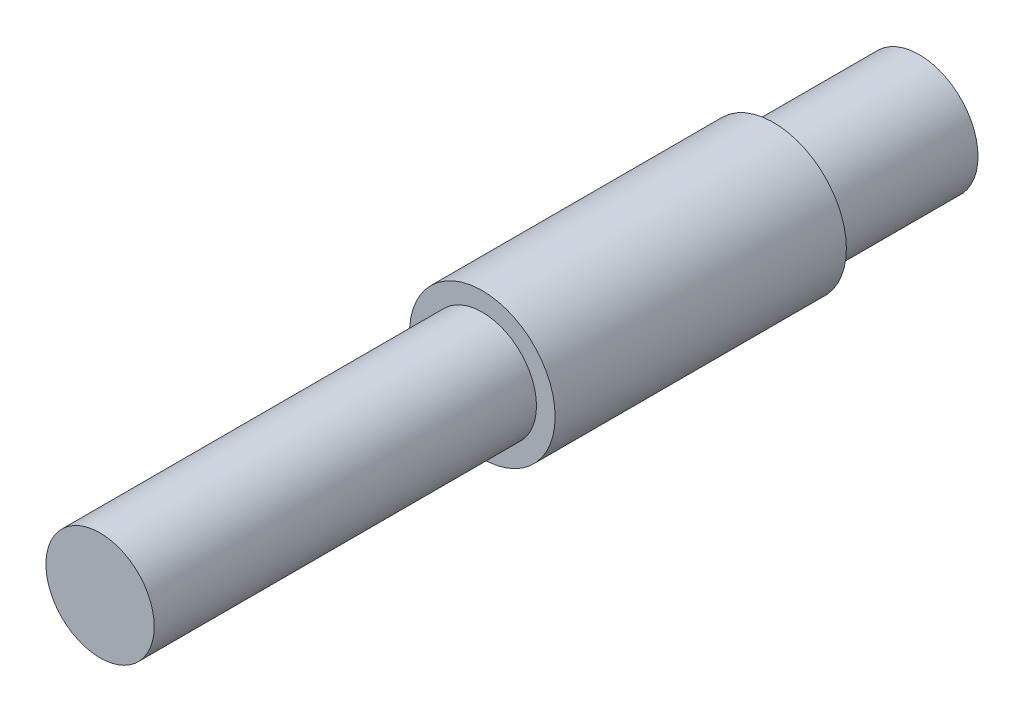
ISO-10303-21;
HEADER;
FILE_DESCRIPTION(('STEP AP214'),'2;1');
FILE_NAME('part.step','',(''),(''),'','','');
FILE_SCHEMA(('AUTOMOTIVE_DESIGN { 1 0 10303 214 1 1 1 1 }'));
ENDSEC;
DATA;
#1=APPLICATION_CONTEXT('core data for automotive mechanical design processes');
#2=APPLICATION_PROTOCOL_DEFINITION('international standard','automotive_design',2000,#1);
#3=PRODUCT_CONTEXT('',#1,'mechanical');
#4=PRODUCT('Part','Part','',(#3));
#5=PRODUCT_RELATED_PRODUCT_CATEGORY('part','',(#4));
#6=PRODUCT_DEFINITION_FORMATION('','',#4);
#7=PRODUCT_DEFINITION_CONTEXT('part definition',#1,'design');
#8=PRODUCT_DEFINITION('design','',#6,#7);
#9=PRODUCT_DEFINITION_SHAPE('','',#8);
#10=(LENGTH_UNIT() NAMED_UNIT(*) SI_UNIT(.MILLI.,.METRE.));
#11=(NAMED_UNIT(*) PLANE_ANGLE_UNIT() SI_UNIT($,.RADIAN.));
#12=(NAMED_UNIT(*) SI_UNIT($,.STERADIAN.) SOLID_ANGLE_UNIT());
#13=UNCERTAINTY_MEASURE_WITH_UNIT(LENGTH_MEASURE(1.E-05),#10,'distance_accuracy_value','');
#14=(GEOMETRIC_REPRESENTATION_CONTEXT(3) GLOBAL_UNCERTAINTY_ASSIGNED_CONTEXT((#13)) GLOBAL_UNIT_ASSIGNED_CONTEXT((#10,
#11,#12)) REPRESENTATION_CONTEXT('',''));
#15=CARTESIAN_POINT('',(0.,0.,0.));
#16=DIRECTION('',(0.,0.,1.));
#17=DIRECTION('',(1.,0.,0.));
#18=AXIS2_PLACEMENT_3D('',#15,#16,#17);
#19=CARTESIAN_POINT('',(0.,0.,8.9296875));
#20=DIRECTION('',(0.,0.,-1.));
#21=DIRECTION('',(-1.,0.,0.));
#22=AXIS2_PLACEMENT_3D('',#19,#20,#21);
#23=PLANE('',#22);
#24=CARTESIAN_POINT('',(0.,0.,8.9296875));
#25=DIRECTION('',(0.,0.,1.));
#26=DIRECTION('',(1.,0.,0.));
#27=AXIS2_PLACEMENT_3D('',#24,#25,#26);
#28=CIRCLE('',#27,1.1811);
#29=CARTESIAN_POINT('',(1.1811,0.,8.9296875));
#30=VERTEX_POINT('',#29);
#31=EDGE_CURVE('E10',#30,#30,#28,.T.);
#32=ORIENTED_EDGE('',*,*,#31,.T.);
#33=EDGE_LOOP('',(#32));
#34=FACE_BOUND('',#33,.T.);
#35=ADVANCED_FACE('F29',(#34),#23,.F.);
#36=CARTESIAN_POINT('',(0.,0.,15.5697488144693));
#37=DIRECTION('',(0.,0.,1.));
#38=DIRECTION('',(1.,0.,0.));
#39=AXIS2_PLACEMENT_3D('',#36,#37,#38);
#40=CYLINDRICAL_SURFACE('',#39,1.1811);
#41=ORIENTED_EDGE('',*,*,#31,.F.);
#42=EDGE_LOOP('',(#41));
#43=FACE_BOUND('',#42,.T.);
#44=CARTESIAN_POINT('',(0.,0.,0.5953125));
#45=DIRECTION('',(0.,0.,1.));
#46=DIRECTION('',(1.,0.,0.));
#47=AXIS2_PLACEMENT_3D('',#44,#45,#46);
#48=CIRCLE('',#47,1.1811);
#49=CARTESIAN_POINT('',(1.1811,0.,0.5953125));
#50=VERTEX_POINT('',#49);
#51=EDGE_CURVE('E35',#50,#50,#48,.T.);
#52=ORIENTED_EDGE('',*,*,#51,.T.);
#53=EDGE_LOOP('',(#52));
#54=FACE_BOUND('',#53,.T.);
#55=ADVANCED_FACE('F67',(#43,#54),#40,.T.);
#56=CARTESIAN_POINT('',(0.,1.1811,0.5953125));
#57=DIRECTION('',(0.,0.,-1.));
#58=DIRECTION('',(-1.,0.,0.));
#59=AXIS2_PLACEMENT_3D('',#56,#57,#58);
#60=PLANE('',#59);
#61=ORIENTED_EDGE('',*,*,#51,.F.);
#62=EDGE_LOOP('',(#61));
#63=FACE_BOUND('',#62,.T.);
#64=CARTESIAN_POINT('',(0.,0.,0.5953125));
#65=DIRECTION('',(0.,0.,1.));
#66=DIRECTION('',(1.,0.,0.));
#67=AXIS2_PLACEMENT_3D('',#64,#65,#66);
#68=CIRCLE('',#67,1.5875);
#69=CARTESIAN_POINT('',(1.5875,0.,0.5953125));
#70=VERTEX_POINT('',#69);
#71=EDGE_CURVE('E39',#70,#70,#68,.T.);
#72=ORIENTED_EDGE('',*,*,#71,.T.);
#73=EDGE_LOOP('',(#72));
#74=FACE_BOUND('',#73,.T.);
#75=ADVANCED_FACE('F71',(#63,#74),#60,.F.);
#76=CARTESIAN_POINT('',(0.,0.,15.5697488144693));
#77=DIRECTION('',(0.,0.,1.));
#78=DIRECTION('',(1.,0.,0.));
#79=AXIS2_PLACEMENT_3D('',#76,#77,#78);
#80=CYLINDRICAL_SURFACE('',#79,1.5875);
#81=ORIENTED_EDGE('',*,*,#71,.F.);
#82=EDGE_LOOP('',(#81));
#83=FACE_BOUND('',#82,.T.);
#84=CARTESIAN_POINT('',(0.,0.,-5.7546875));
#85=DIRECTION('',(0.,0.,1.));
#86=DIRECTION('',(1.,0.,0.));
#87=AXIS2_PLACEMENT_3D('',#84,#85,#86);
#88=CIRCLE('',#87,1.5875);
#89=CARTESIAN_POINT('',(1.5875,0.,-5.7546875));
#90=VERTEX_POINT('',#89);
#91=EDGE_CURVE('E43',#90,#90,#88,.T.);
#92=ORIENTED_EDGE('',*,*,#91,.T.);
#93=EDGE_LOOP('',(#92));
#94=FACE_BOUND('',#93,.T.);
#95=ADVANCED_FACE('F76',(#83,#94),#80,.T.);
#96=CARTESIAN_POINT('',(0.,1.5875,-5.7546875));
#97=DIRECTION('',(0.,0.,1.));
#98=DIRECTION('',(1.,0.,0.));
#99=AXIS2_PLACEMENT_3D('',#96,#97,#98);
#100=PLANE('',#99);
#101=ORIENTED_EDGE('',*,*,#91,.F.);
#102=EDGE_LOOP('',(#101));
#103=FACE_BOUND('',#102,.T.);
#104=CARTESIAN_POINT('',(0.,0.,-5.7546875));
#105=DIRECTION('',(0.,0.,1.));
#106=DIRECTION('',(1.,0.,0.));
#107=AXIS2_PLACEMENT_3D('',#104,#105,#106);
#108=CIRCLE('',#107,1.2827);
#109=CARTESIAN_POINT('',(1.2827,0.,-5.7546875));
#110=VERTEX_POINT('',#109);
#111=EDGE_CURVE('E48',#110,#110,#108,.T.);
#112=ORIENTED_EDGE('',*,*,#111,.T.);
#113=EDGE_LOOP('',(#112));
#114=FACE_BOUND('',#113,.T.);
#115=ADVANCED_FACE('F63',(#103,#114),#100,.F.);
#116=CARTESIAN_POINT('',(0.,0.,15.5697488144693));
#117=DIRECTION('',(0.,0.,1.));
#118=DIRECTION('',(1.,0.,0.));
#119=AXIS2_PLACEMENT_3D('',#116,#117,#118);
#120=CYLINDRICAL_SURFACE('',#119,1.2827);
#121=ORIENTED_EDGE('',*,*,#111,.F.);
#122=EDGE_LOOP('',(#121));
#123=FACE_BOUND('',#122,.T.);
#124=CARTESIAN_POINT('',(0.,0.,-8.9296875));
#125=DIRECTION('',(0.,0.,1.));
#126=DIRECTION('',(1.,0.,0.));
#127=AXIS2_PLACEMENT_3D('',#124,#125,#126);
#128=CIRCLE('',#127,1.2827);
#129=CARTESIAN_POINT('',(1.2827,0.,-8.9296875));
#130=VERTEX_POINT('',#129);
#131=EDGE_CURVE('E51',#130,#130,#128,.T.);
#132=ORIENTED_EDGE('',*,*,#131,.T.);
#133=EDGE_LOOP('',(#132));
#134=FACE_BOUND('',#133,.T.);
#135=ADVANCED_FACE('F55',(#123,#134),#120,.T.);
#136=CARTESIAN_POINT('',(0.,1.2827,-8.9296875));
#137=DIRECTION('',(0.,0.,1.));
#138=DIRECTION('',(1.,0.,0.));
#139=AXIS2_PLACEMENT_3D('',#136,#137,#138);
#140=PLANE('',#139);
#141=ORIENTED_EDGE('',*,*,#131,.F.);
#142=EDGE_LOOP('',(#141));
#143=FACE_BOUND('',#142,.T.);
#144=ADVANCED_FACE('F57',(#143),#140,.F.);
#145=CLOSED_SHELL('',(#35,#55,#75,#95,#115,#135,#144));
#146=MANIFOLD_SOLID_BREP('B2',#145);
#147=ADVANCED_BREP_SHAPE_REPRESENTATION('',(#18,#146),#14);
#148=SHAPE_DEFINITION_REPRESENTATION(#9,#147);
ENDSEC;
END-ISO-10303-21;
